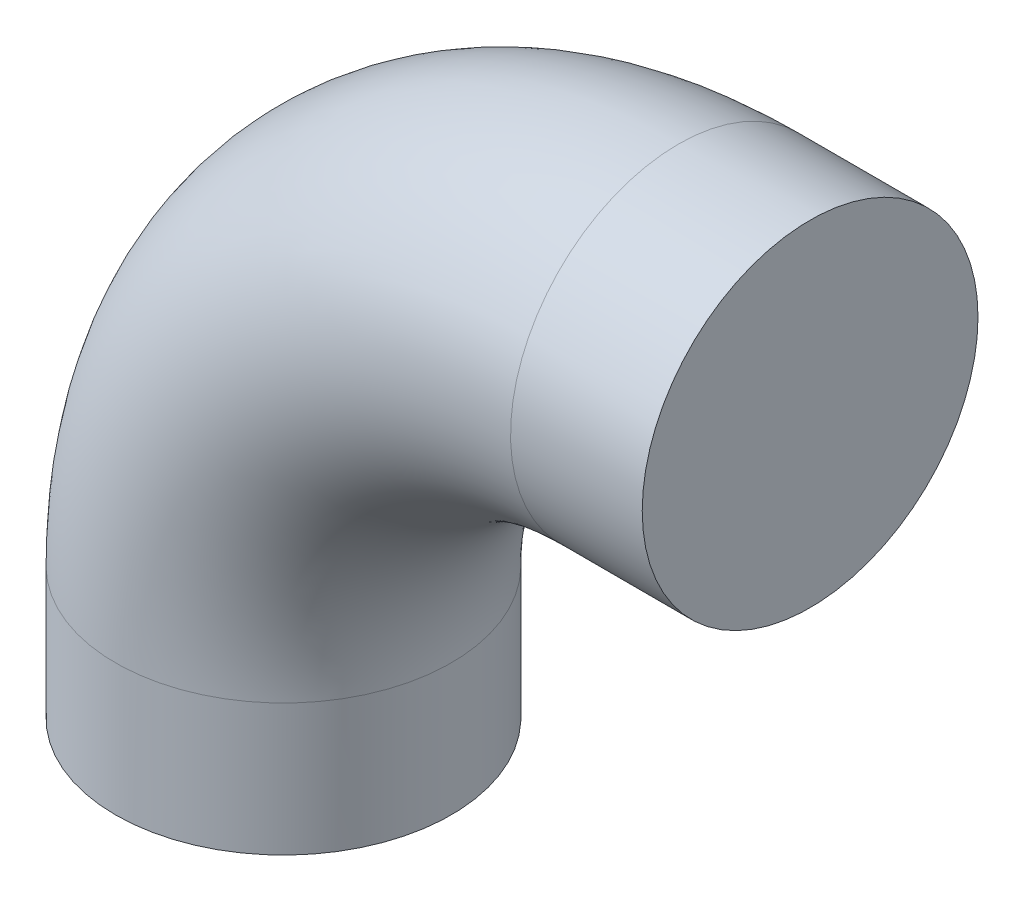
ISO-10303-21;
HEADER;
FILE_DESCRIPTION(('STEP AP214'),'2;1');
FILE_NAME('part.step','',(''),(''),'','','');
FILE_SCHEMA(('AUTOMOTIVE_DESIGN { 1 0 10303 214 1 1 1 1 }'));
ENDSEC;
DATA;
#1=APPLICATION_CONTEXT('core data for automotive mechanical design processes');
#2=APPLICATION_PROTOCOL_DEFINITION('international standard','automotive_design',2000,#1);
#3=PRODUCT_CONTEXT('',#1,'mechanical');
#4=PRODUCT('Part','Part','',(#3));
#5=PRODUCT_RELATED_PRODUCT_CATEGORY('part','',(#4));
#6=PRODUCT_DEFINITION_FORMATION('','',#4);
#7=PRODUCT_DEFINITION_CONTEXT('part definition',#1,'design');
#8=PRODUCT_DEFINITION('design','',#6,#7);
#9=PRODUCT_DEFINITION_SHAPE('','',#8);
#10=(LENGTH_UNIT() NAMED_UNIT(*) SI_UNIT(.MILLI.,.METRE.));
#11=(NAMED_UNIT(*) PLANE_ANGLE_UNIT() SI_UNIT($,.RADIAN.));
#12=(NAMED_UNIT(*) SI_UNIT($,.STERADIAN.) SOLID_ANGLE_UNIT());
#13=UNCERTAINTY_MEASURE_WITH_UNIT(LENGTH_MEASURE(1.E-05),#10,'distance_accuracy_value','');
#14=(GEOMETRIC_REPRESENTATION_CONTEXT(3) GLOBAL_UNCERTAINTY_ASSIGNED_CONTEXT((#13)) GLOBAL_UNIT_ASSIGNED_CONTEXT((#10,
#11,#12)) REPRESENTATION_CONTEXT('',''));
#15=CARTESIAN_POINT('',(0.,0.,0.));
#16=DIRECTION('',(0.,0.,1.));
#17=DIRECTION('',(1.,0.,0.));
#18=AXIS2_PLACEMENT_3D('',#15,#16,#17);
#19=CARTESIAN_POINT('',(0.,0.,0.));
#20=DIRECTION('',(1.,0.,0.));
#21=DIRECTION('',(0.,0.,-1.));
#22=AXIS2_PLACEMENT_3D('',#19,#20,#21);
#23=PLANE('',#22);
#24=CARTESIAN_POINT('',(0.,0.,0.));
#25=DIRECTION('',(1.,0.,0.));
#26=DIRECTION('',(0.,0.,-1.));
#27=AXIS2_PLACEMENT_3D('',#24,#25,#26);
#28=CIRCLE('',#27,0.6477);
#29=CARTESIAN_POINT('',(0.,0.,-0.6477));
#30=VERTEX_POINT('',#29);
#31=EDGE_CURVE('E44',#30,#30,#28,.T.);
#32=ORIENTED_EDGE('',*,*,#31,.T.);
#33=EDGE_LOOP('',(#32));
#34=FACE_BOUND('',#33,.T.);
#35=ADVANCED_FACE('F32',(#34),#23,.T.);
#36=CARTESIAN_POINT('',(-2.032,-2.032,0.));
#37=DIRECTION('',(0.,1.,0.));
#38=DIRECTION('',(0.,0.,-1.));
#39=AXIS2_PLACEMENT_3D('',#36,#37,#38);
#40=PLANE('',#39);
#41=CARTESIAN_POINT('',(-2.032,-2.032,0.));
#42=DIRECTION('',(0.,1.,0.));
#43=DIRECTION('',(0.,0.,-1.));
#44=AXIS2_PLACEMENT_3D('',#41,#42,#43);
#45=CIRCLE('',#44,0.6477);
#46=CARTESIAN_POINT('',(-2.032,-2.032,-0.6477));
#47=VERTEX_POINT('',#46);
#48=EDGE_CURVE('E11',#47,#47,#45,.T.);
#49=ORIENTED_EDGE('',*,*,#48,.F.);
#50=EDGE_LOOP('',(#49));
#51=FACE_BOUND('',#50,.T.);
#52=ADVANCED_FACE('F50',(#51),#40,.F.);
#53=CARTESIAN_POINT('',(0.,0.,0.));
#54=DIRECTION('',(-1.,0.,0.));
#55=DIRECTION('',(0.,-1.,0.));
#56=AXIS2_PLACEMENT_3D('',#53,#54,#55);
#57=CYLINDRICAL_SURFACE('',#56,0.6477);
#58=CARTESIAN_POINT('',(-0.507999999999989,0.,0.));
#59=DIRECTION('',(1.,0.,0.));
#60=DIRECTION('',(0.,0.,-1.));
#61=AXIS2_PLACEMENT_3D('',#58,#59,#60);
#62=CIRCLE('',#61,0.6477);
#63=CARTESIAN_POINT('',(-0.507999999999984,0.6477,0.));
#64=VERTEX_POINT('',#63);
#65=EDGE_CURVE('E75',#64,#64,#62,.T.);
#66=ORIENTED_EDGE('',*,*,#65,.T.);
#67=EDGE_LOOP('',(#66));
#68=FACE_BOUND('',#67,.T.);
#69=ORIENTED_EDGE('',*,*,#31,.F.);
#70=EDGE_LOOP('',(#69));
#71=FACE_BOUND('',#70,.T.);
#72=ADVANCED_FACE('F52',(#68,#71),#57,.T.);
#73=CARTESIAN_POINT('',(-0.508,-1.524,0.));
#74=DIRECTION('',(0.,0.,1.));
#75=DIRECTION('',(1.,0.,0.));
#76=AXIS2_PLACEMENT_3D('',#73,#74,#75);
#77=TOROIDAL_SURFACE('',#76,1.524,0.6477);
#78=CARTESIAN_POINT('',(-2.032,-1.52400000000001,0.));
#79=DIRECTION('',(0.,1.,0.));
#80=DIRECTION('',(0.,0.,-1.));
#81=AXIS2_PLACEMENT_3D('',#78,#79,#80);
#82=CIRCLE('',#81,0.6477);
#83=CARTESIAN_POINT('',(-2.6797,-1.52400000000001,0.));
#84=VERTEX_POINT('',#83);
#85=EDGE_CURVE('E39',#84,#84,#82,.T.);
#86=CARTESIAN_POINT('',(-0.508,-1.524,0.));
#87=DIRECTION('',(0.,0.,1.));
#88=DIRECTION('',(1.,0.,0.));
#89=AXIS2_PLACEMENT_3D('',#86,#87,#88);
#90=CIRCLE('',#89,2.1717);
#91=EDGE_CURVE('',#64,#84,#90,.T.);
#92=ORIENTED_EDGE('',*,*,#65,.F.);
#93=ORIENTED_EDGE('',*,*,#85,.T.);
#94=ORIENTED_EDGE('',*,*,#91,.T.);
#95=ORIENTED_EDGE('',*,*,#91,.F.);
#96=EDGE_LOOP('',(#92,#94,#93,#95));
#97=FACE_BOUND('',#96,.T.);
#98=ADVANCED_FACE('F57',(#97),#77,.T.);
#99=CARTESIAN_POINT('',(-2.032,-1.52400000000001,0.));
#100=DIRECTION('',(0.,-1.,0.));
#101=DIRECTION('',(0.,0.,-1.));
#102=AXIS2_PLACEMENT_3D('',#99,#100,#101);
#103=CYLINDRICAL_SURFACE('',#102,0.6477);
#104=ORIENTED_EDGE('',*,*,#48,.T.);
#105=EDGE_LOOP('',(#104));
#106=FACE_BOUND('',#105,.T.);
#107=ORIENTED_EDGE('',*,*,#85,.F.);
#108=EDGE_LOOP('',(#107));
#109=FACE_BOUND('',#108,.T.);
#110=ADVANCED_FACE('F47',(#106,#109),#103,.T.);
#111=CLOSED_SHELL('',(#35,#52,#72,#98,#110));
#112=MANIFOLD_SOLID_BREP('B2',#111);
#113=ADVANCED_BREP_SHAPE_REPRESENTATION('',(#18,#112),#14);
#114=SHAPE_DEFINITION_REPRESENTATION(#9,#113);
ENDSEC;
END-ISO-10303-21;
